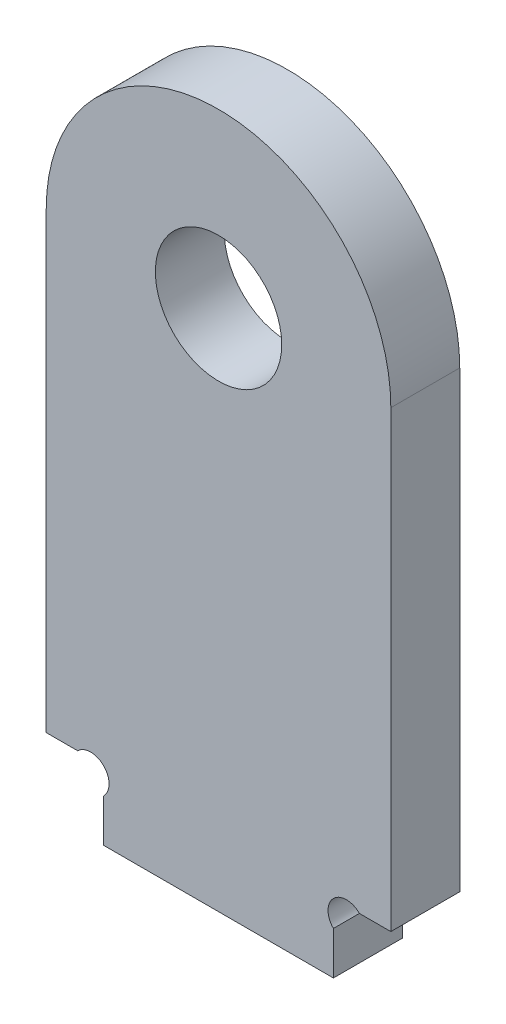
from build123d import *

# Parameters (mm, degrees)
ESQUISSE1_R      = 5.5
EXTRUSION1_DEPTH = 6


with BuildPart() as part:
    # Esquisse1 → Extrusion1 (new body)
    with BuildSketch(Plane.XY):
        with BuildLine():
            Line((0, 39.5), (0, 0))
            Line((0, 0), (2.7372583, 0))
            ThreePointArc((2.7372583, 0), (5, 0), (5, -2.2627417))
            Line((5, -2.2627417), (5, -6))
            Line((5, -6), (25, -6))
            Line((25, -6), (25, -2.2627417))
            ThreePointArc((25, -2.2627417), (25, 0), (27.2627417, 0))
            Line((27.2627417, 0), (30, 0))
            Line((30, 0), (30, 39.5))
            ThreePointArc((30, 39.5), (15, 54.5), (0, 39.5))
        make_face()
        with Locations((15, 39.5)):
            Circle(ESQUISSE1_R, mode=Mode.SUBTRACT)
    extrude(amount=EXTRUSION1_DEPTH)


solid = part.part
